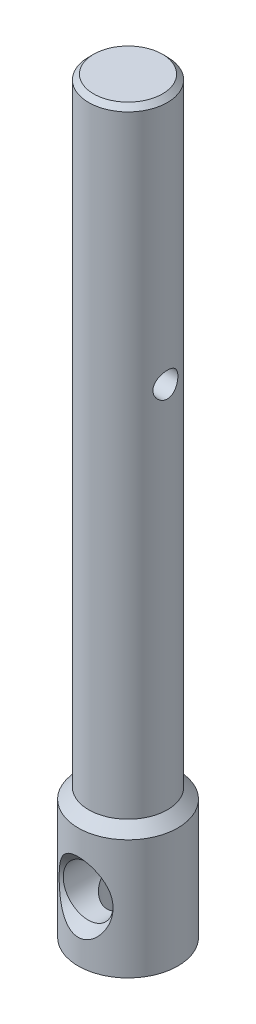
from build123d import *

# Parameters (mm, degrees)
TROU_TARAUD_M31_D      = 2.5
TROU_TARAUD_M31_DEPTH  = 6.5
TROU_TARAUD_M31_TIP    = 0.721687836
CHANFREIN1_SIZE        = 0.5
TROU_TARAUD_M52_REACH  = 77.333
TROU_TARAUD_M52_BORE_R = 2.1


with BuildPart() as part:
    # Esquisse1 → R_volution1 (revolve)
    with BuildSketch(Plane.XY, mode=Mode.PRIVATE) as r_volution1_sk:
        Polygon((0, 0), (-5, 0), (-5, 12), (-3.95, 13.05), (-3.95, 75), (0, 75), align=None)
    revolve(r_volution1_sk.sketch.rotate(Axis((0, 0, 0), (0, 1, 0)), 270), axis=Axis((0, 0, 0), (0, 1, 0)))

    # Esquisse3 → Enl_vement de mati_re-R_volution1 (revolve, cut)
    with BuildSketch(Plane(origin=(0, 0, 0), x_dir=(0, 0, -1), z_dir=(1, 0, 0)), mode=Mode.PRIVATE) as enl_vement_de_mati_re_r_volution1_sk:
        Polygon((-5, 9.5), (-4, 8.5), (4, 8.5), (5, 9.5), (5, 6), (-5, 6), align=None)
    revolve(enl_vement_de_mati_re_r_volution1_sk.sketch.rotate(Axis((0, 6, 5), (0, 0, -1)), 90), axis=Axis((0, 6, 5), (0, 0, -1)), mode=Mode.SUBTRACT)

    # Trou taraud_ M31
    with Locations(Plane(origin=(3.95, 0, 0), x_dir=(0, 0, -1), z_dir=(1, 0, 0))):
        with Locations((0, 50)):
            Hole(TROU_TARAUD_M31_D / 2, depth=TROU_TARAUD_M31_DEPTH)
            with Locations((0, 0, -(TROU_TARAUD_M31_DEPTH + TROU_TARAUD_M31_TIP / 2))):  # 120° drill point
                Cone(0, TROU_TARAUD_M31_D / 2, TROU_TARAUD_M31_TIP, mode=Mode.SUBTRACT)

    # Chanfrein1
    chanfrein1_edges = [part.edges().sort_by_distance(p)[0] for p in [
        (0, 75, 3.95),
    ]]
    chamfer(chanfrein1_edges, length=CHANFREIN1_SIZE)

    # Trou taraud_ M52 bore → Trou taraud_ M52 (cut, up to next)
    with BuildSketch(Plane(origin=(0, 0, 0), x_dir=(-1, 0, 0), z_dir=(0, -1, 0)), mode=Mode.PRIVATE) as trou_taraud_m52_sk1:
        Circle(TROU_TARAUD_M52_BORE_R)
    trou_taraud_m52_tool1 = extrude(trou_taraud_m52_sk1.sketch, amount=-TROU_TARAUD_M52_REACH, mode=Mode.PRIVATE) & part.part
    add(trou_taraud_m52_tool1.solids().sort_by_distance((0, 0, 0))[0], mode=Mode.SUBTRACT)


solid = part.part
